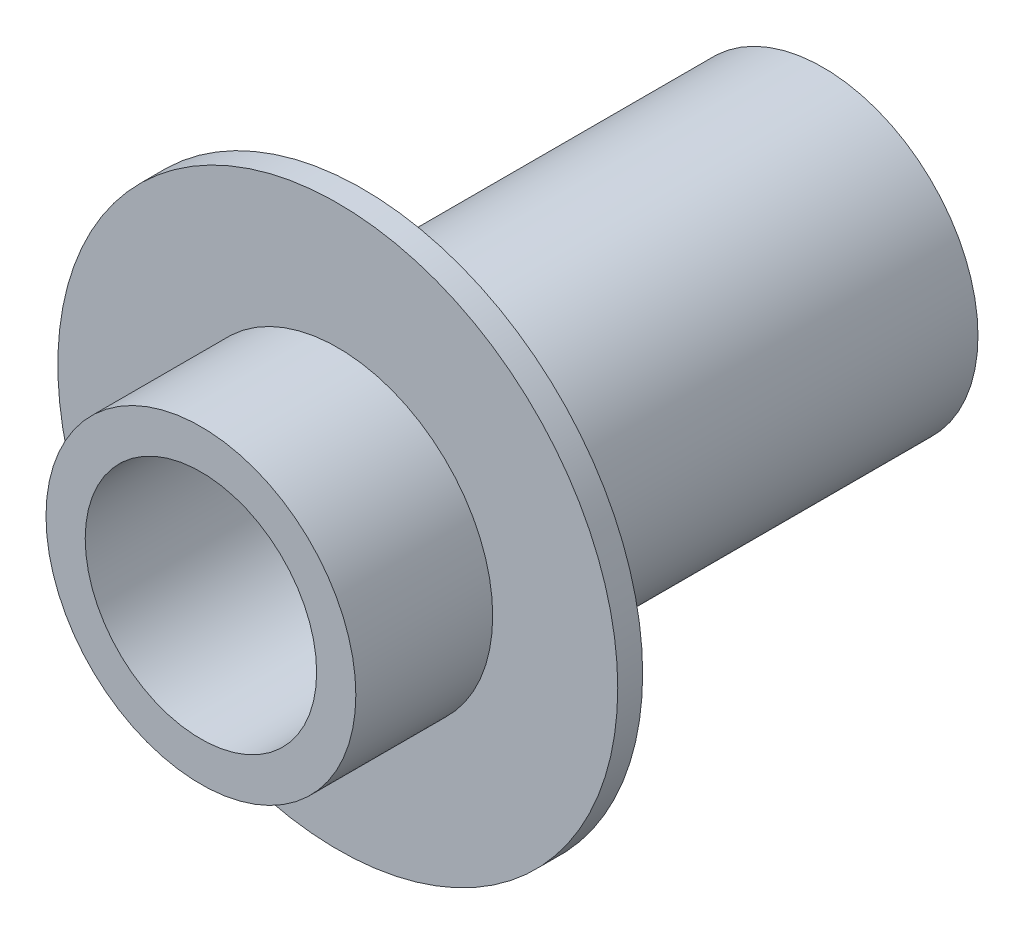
from build123d import *

# Parameters (mm, degrees)
SKETCH1_R           = 3.1623
SKETCH1_R_2         = 2.3622
BASE_EXTRUDE_DEPTH  = 9.398
SKETCH2_R           = 5.715
SKETCH2_R_2         = 2.3622
BOSS_EXTRUDE1_DEPTH = 0.508
SKETCH3_R           = 3.1623
SKETCH3_R_2         = 2.3622
BOSS_EXTRUDE2_DEPTH = 3.302


with BuildPart() as part:
    # Sketch1 → Base-Extrude (new body)
    with BuildSketch(Plane.XY):
        Circle(SKETCH1_R)
        with Locations(Location((0, 0, 0), (0, 0, 180))):
            Circle(SKETCH1_R_2, mode=Mode.SUBTRACT)
    extrude(amount=BASE_EXTRUDE_DEPTH)

    # Sketch2 → Boss-Extrude1 (add)
    with BuildSketch(Plane.XY.offset(9.398)):
        Circle(SKETCH2_R)
        with Locations(Location((0, 0, 0), (0, 0, 180))):
            Circle(SKETCH2_R_2, mode=Mode.SUBTRACT)
    extrude(amount=BOSS_EXTRUDE1_DEPTH)

    # Sketch3 → Boss-Extrude2 (add)
    with BuildSketch(Plane(origin=(0, 0, 9.398), x_dir=(-1, 0, 0), z_dir=(0, 0, -1))):
        with Locations(Location((0, 0, 0), (0, 0, 180))):
            Circle(SKETCH3_R)
        Circle(SKETCH3_R_2, mode=Mode.SUBTRACT)
    extrude(amount=-BOSS_EXTRUDE2_DEPTH)


solid = part.part
